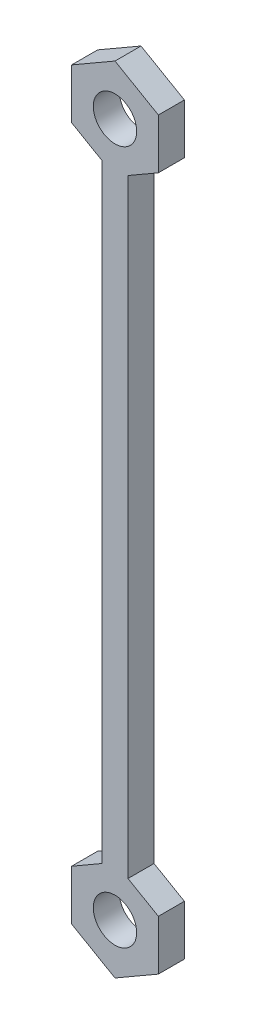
from build123d import *

# Parameters (mm, degrees)
CROQUIS1_R              = 2.5
SALIENTE_EXTRUIR1_DEPTH = 1.5


with BuildPart() as part:
    # Croquis1 → Saliente-Extruir1 (new, symmetric)
    with BuildSketch(Plane.XY):
        Polygon((1.5, 35.092522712), (1.5, -35.092522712), (5, -37.113248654), (5, -42.886751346), (0, -45.773502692), (-5, -42.886751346), (-5, -37.113248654), (-1.5, -35.092522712), (-1.5, 35.092522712), (-5, 37.113248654), (-5, 42.886751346), (0, 45.773502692), (5, 42.886751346), (5, 37.113248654), align=None)
        with Locations((0, -40)):
            Circle(CROQUIS1_R, mode=Mode.SUBTRACT)
        with Locations((0, 40)):
            Circle(CROQUIS1_R, mode=Mode.SUBTRACT)
    extrude(amount=SALIENTE_EXTRUIR1_DEPTH, both=True)


solid = part.part
